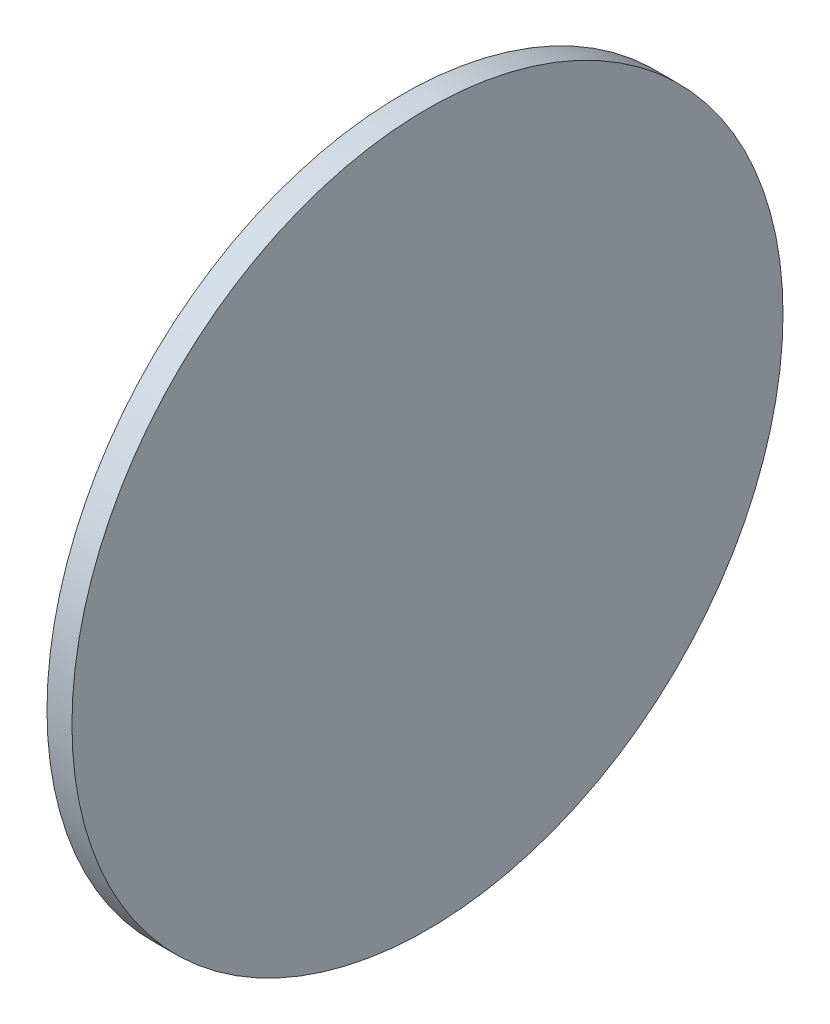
ISO-10303-21;
HEADER;
FILE_DESCRIPTION(('STEP AP214'),'2;1');
FILE_NAME('part.step','',(''),(''),'','','');
FILE_SCHEMA(('AUTOMOTIVE_DESIGN { 1 0 10303 214 1 1 1 1 }'));
ENDSEC;
DATA;
#1=APPLICATION_CONTEXT('core data for automotive mechanical design processes');
#2=APPLICATION_PROTOCOL_DEFINITION('international standard','automotive_design',2000,#1);
#3=PRODUCT_CONTEXT('',#1,'mechanical');
#4=PRODUCT('Part','Part','',(#3));
#5=PRODUCT_RELATED_PRODUCT_CATEGORY('part','',(#4));
#6=PRODUCT_DEFINITION_FORMATION('','',#4);
#7=PRODUCT_DEFINITION_CONTEXT('part definition',#1,'design');
#8=PRODUCT_DEFINITION('design','',#6,#7);
#9=PRODUCT_DEFINITION_SHAPE('','',#8);
#10=(LENGTH_UNIT() NAMED_UNIT(*) SI_UNIT(.MILLI.,.METRE.));
#11=(NAMED_UNIT(*) PLANE_ANGLE_UNIT() SI_UNIT($,.RADIAN.));
#12=(NAMED_UNIT(*) SI_UNIT($,.STERADIAN.) SOLID_ANGLE_UNIT());
#13=UNCERTAINTY_MEASURE_WITH_UNIT(LENGTH_MEASURE(1.E-05),#10,'distance_accuracy_value','');
#14=(GEOMETRIC_REPRESENTATION_CONTEXT(3) GLOBAL_UNCERTAINTY_ASSIGNED_CONTEXT((#13)) GLOBAL_UNIT_ASSIGNED_CONTEXT((#10,
#11,#12)) REPRESENTATION_CONTEXT('',''));
#15=CARTESIAN_POINT('',(0.,0.,0.));
#16=DIRECTION('',(0.,0.,1.));
#17=DIRECTION('',(1.,0.,0.));
#18=AXIS2_PLACEMENT_3D('',#15,#16,#17);
#19=CARTESIAN_POINT('',(5.,0.,0.));
#20=DIRECTION('',(-1.,0.,0.));
#21=DIRECTION('',(0.,0.,1.));
#22=AXIS2_PLACEMENT_3D('',#19,#20,#21);
#23=CYLINDRICAL_SURFACE('',#22,71.25);
#24=CARTESIAN_POINT('',(5.,0.,0.));
#25=DIRECTION('',(1.,0.,0.));
#26=DIRECTION('',(0.,0.,-1.));
#27=AXIS2_PLACEMENT_3D('',#24,#25,#26);
#28=CIRCLE('',#27,71.25);
#29=CARTESIAN_POINT('',(5.,0.,-71.25));
#30=VERTEX_POINT('',#29);
#31=EDGE_CURVE('E10',#30,#30,#28,.T.);
#32=ORIENTED_EDGE('',*,*,#31,.F.);
#33=EDGE_LOOP('',(#32));
#34=FACE_BOUND('',#33,.T.);
#35=CARTESIAN_POINT('',(0.,0.,0.));
#36=DIRECTION('',(1.,0.,0.));
#37=DIRECTION('',(0.,0.,-1.));
#38=AXIS2_PLACEMENT_3D('',#35,#36,#37);
#39=CIRCLE('',#38,71.25);
#40=CARTESIAN_POINT('',(0.,0.,-71.25));
#41=VERTEX_POINT('',#40);
#42=EDGE_CURVE('E34',#41,#41,#39,.T.);
#43=ORIENTED_EDGE('',*,*,#42,.T.);
#44=EDGE_LOOP('',(#43));
#45=FACE_BOUND('',#44,.T.);
#46=ADVANCED_FACE('F31',(#34,#45),#23,.T.);
#47=CARTESIAN_POINT('',(5.,0.,0.));
#48=DIRECTION('',(1.,0.,0.));
#49=DIRECTION('',(0.,0.,-1.));
#50=AXIS2_PLACEMENT_3D('',#47,#48,#49);
#51=PLANE('',#50);
#52=ORIENTED_EDGE('',*,*,#31,.T.);
#53=EDGE_LOOP('',(#52));
#54=FACE_BOUND('',#53,.T.);
#55=ADVANCED_FACE('F46',(#54),#51,.T.);
#56=CARTESIAN_POINT('',(0.,0.,0.));
#57=DIRECTION('',(1.,0.,0.));
#58=DIRECTION('',(0.,0.,-1.));
#59=AXIS2_PLACEMENT_3D('',#56,#57,#58);
#60=PLANE('',#59);
#61=ORIENTED_EDGE('',*,*,#42,.F.);
#62=EDGE_LOOP('',(#61));
#63=FACE_BOUND('',#62,.T.);
#64=ADVANCED_FACE('F44',(#63),#60,.F.);
#65=CLOSED_SHELL('',(#46,#55,#64));
#66=MANIFOLD_SOLID_BREP('B2',#65);
#67=ADVANCED_BREP_SHAPE_REPRESENTATION('',(#18,#66),#14);
#68=SHAPE_DEFINITION_REPRESENTATION(#9,#67);
ENDSEC;
END-ISO-10303-21;
